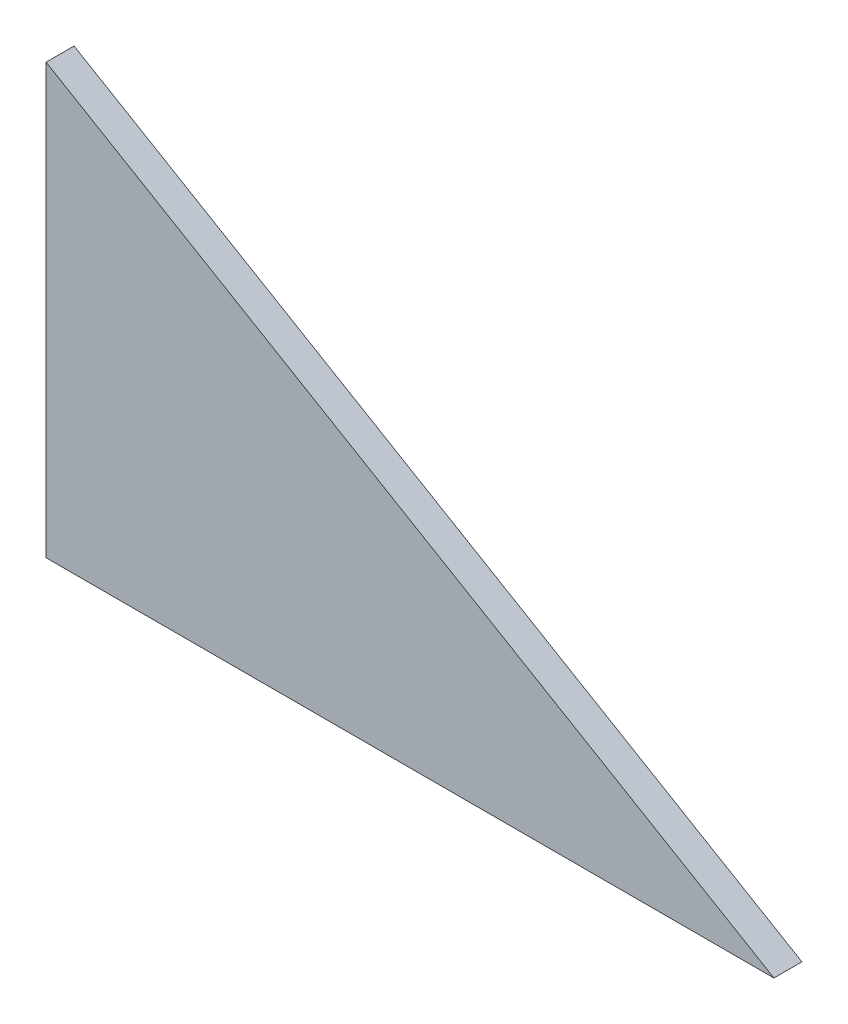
ISO-10303-21;
HEADER;
FILE_DESCRIPTION(('STEP AP214'),'2;1');
FILE_NAME('part.step','',(''),(''),'','','');
FILE_SCHEMA(('AUTOMOTIVE_DESIGN { 1 0 10303 214 1 1 1 1 }'));
ENDSEC;
DATA;
#1=APPLICATION_CONTEXT('core data for automotive mechanical design processes');
#2=APPLICATION_PROTOCOL_DEFINITION('international standard','automotive_design',2000,#1);
#3=PRODUCT_CONTEXT('',#1,'mechanical');
#4=PRODUCT('Part','Part','',(#3));
#5=PRODUCT_RELATED_PRODUCT_CATEGORY('part','',(#4));
#6=PRODUCT_DEFINITION_FORMATION('','',#4);
#7=PRODUCT_DEFINITION_CONTEXT('part definition',#1,'design');
#8=PRODUCT_DEFINITION('design','',#6,#7);
#9=PRODUCT_DEFINITION_SHAPE('','',#8);
#10=(LENGTH_UNIT() NAMED_UNIT(*) SI_UNIT(.MILLI.,.METRE.));
#11=(NAMED_UNIT(*) PLANE_ANGLE_UNIT() SI_UNIT($,.RADIAN.));
#12=(NAMED_UNIT(*) SI_UNIT($,.STERADIAN.) SOLID_ANGLE_UNIT());
#13=UNCERTAINTY_MEASURE_WITH_UNIT(LENGTH_MEASURE(1.E-05),#10,'distance_accuracy_value','');
#14=(GEOMETRIC_REPRESENTATION_CONTEXT(3) GLOBAL_UNCERTAINTY_ASSIGNED_CONTEXT((#13)) GLOBAL_UNIT_ASSIGNED_CONTEXT((#10,
#11,#12)) REPRESENTATION_CONTEXT('',''));
#15=CARTESIAN_POINT('',(0.,0.,0.));
#16=DIRECTION('',(0.,0.,1.));
#17=DIRECTION('',(1.,0.,0.));
#18=AXIS2_PLACEMENT_3D('',#15,#16,#17);
#19=CARTESIAN_POINT('',(247.65,0.,9.525));
#20=DIRECTION('',(0.,1.,0.));
#21=DIRECTION('',(-1.,0.,0.));
#22=AXIS2_PLACEMENT_3D('',#19,#20,#21);
#23=PLANE('',#22);
#24=DIRECTION('',(1.,0.,0.));
#25=VECTOR('',#24,1.);
#26=CARTESIAN_POINT('',(247.65,0.,0.));
#27=LINE('',#26,#25);
#28=CARTESIAN_POINT('',(0.,0.,0.));
#29=VERTEX_POINT('',#28);
#30=CARTESIAN_POINT('',(247.65,0.,0.));
#31=VERTEX_POINT('',#30);
#32=EDGE_CURVE('E83',#29,#31,#27,.T.);
#33=ORIENTED_EDGE('',*,*,#32,.T.);
#34=DIRECTION('',(0.,0.,-1.));
#35=VECTOR('',#34,1.);
#36=CARTESIAN_POINT('',(247.65,0.,9.525));
#37=LINE('',#36,#35);
#38=CARTESIAN_POINT('',(247.65,0.,9.525));
#39=VERTEX_POINT('',#38);
#40=EDGE_CURVE('E11',#39,#31,#37,.T.);
#41=ORIENTED_EDGE('',*,*,#40,.F.);
#42=DIRECTION('',(1.,0.,0.));
#43=VECTOR('',#42,1.);
#44=CARTESIAN_POINT('',(247.65,0.,9.525));
#45=LINE('',#44,#43);
#46=CARTESIAN_POINT('',(0.,0.,9.525));
#47=VERTEX_POINT('',#46);
#48=EDGE_CURVE('E76',#47,#39,#45,.T.);
#49=ORIENTED_EDGE('',*,*,#48,.F.);
#50=DIRECTION('',(0.,0.,-1.));
#51=VECTOR('',#50,1.);
#52=CARTESIAN_POINT('',(0.,0.,9.525));
#53=LINE('',#52,#51);
#54=EDGE_CURVE('E84',#47,#29,#53,.T.);
#55=ORIENTED_EDGE('',*,*,#54,.T.);
#56=EDGE_LOOP('',(#33,#41,#49,#55));
#57=FACE_BOUND('',#56,.T.);
#58=ADVANCED_FACE('F36',(#57),#23,.F.);
#59=CARTESIAN_POINT('',(0.,146.05,9.525));
#60=DIRECTION('',(-0.507985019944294,-0.861365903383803,0.));
#61=DIRECTION('',(0.861365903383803,-0.507985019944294,0.));
#62=AXIS2_PLACEMENT_3D('',#59,#60,#61);
#63=PLANE('',#62);
#64=DIRECTION('',(-0.861365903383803,0.507985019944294,0.));
#65=VECTOR('',#64,1.);
#66=CARTESIAN_POINT('',(0.,146.05,0.));
#67=LINE('',#66,#65);
#68=CARTESIAN_POINT('',(0.,146.05,0.));
#69=VERTEX_POINT('',#68);
#70=EDGE_CURVE('E64',#31,#69,#67,.T.);
#71=ORIENTED_EDGE('',*,*,#70,.T.);
#72=DIRECTION('',(0.,0.,-1.));
#73=VECTOR('',#72,1.);
#74=CARTESIAN_POINT('',(0.,146.05,9.525));
#75=LINE('',#74,#73);
#76=CARTESIAN_POINT('',(0.,146.05,9.525));
#77=VERTEX_POINT('',#76);
#78=EDGE_CURVE('E44',#77,#69,#75,.T.);
#79=ORIENTED_EDGE('',*,*,#78,.F.);
#80=DIRECTION('',(-0.861365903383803,0.507985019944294,0.));
#81=VECTOR('',#80,1.);
#82=CARTESIAN_POINT('',(0.,146.05,9.525));
#83=LINE('',#82,#81);
#84=EDGE_CURVE('E72',#39,#77,#83,.T.);
#85=ORIENTED_EDGE('',*,*,#84,.F.);
#86=ORIENTED_EDGE('',*,*,#40,.T.);
#87=EDGE_LOOP('',(#71,#79,#85,#86));
#88=FACE_BOUND('',#87,.T.);
#89=ADVANCED_FACE('F73',(#88),#63,.F.);
#90=CARTESIAN_POINT('',(0.,0.,9.525));
#91=DIRECTION('',(1.,0.,0.));
#92=DIRECTION('',(0.,1.,0.));
#93=AXIS2_PLACEMENT_3D('',#90,#91,#92);
#94=PLANE('',#93);
#95=DIRECTION('',(0.,-1.,0.));
#96=VECTOR('',#95,1.);
#97=CARTESIAN_POINT('',(0.,0.,0.));
#98=LINE('',#97,#96);
#99=EDGE_CURVE('E69',#69,#29,#98,.T.);
#100=ORIENTED_EDGE('',*,*,#99,.T.);
#101=ORIENTED_EDGE('',*,*,#54,.F.);
#102=DIRECTION('',(0.,-1.,0.));
#103=VECTOR('',#102,1.);
#104=CARTESIAN_POINT('',(0.,0.,9.525));
#105=LINE('',#104,#103);
#106=EDGE_CURVE('E52',#77,#47,#105,.T.);
#107=ORIENTED_EDGE('',*,*,#106,.F.);
#108=ORIENTED_EDGE('',*,*,#78,.T.);
#109=EDGE_LOOP('',(#100,#101,#107,#108));
#110=FACE_BOUND('',#109,.T.);
#111=ADVANCED_FACE('F91',(#110),#94,.F.);
#112=CARTESIAN_POINT('',(0.,0.,9.525));
#113=DIRECTION('',(0.,0.,-1.));
#114=DIRECTION('',(-1.,0.,0.));
#115=AXIS2_PLACEMENT_3D('',#112,#113,#114);
#116=PLANE('',#115);
#117=ORIENTED_EDGE('',*,*,#48,.T.);
#118=ORIENTED_EDGE('',*,*,#84,.T.);
#119=ORIENTED_EDGE('',*,*,#106,.T.);
#120=EDGE_LOOP('',(#117,#118,#119));
#121=FACE_BOUND('',#120,.T.);
#122=ADVANCED_FACE('F79',(#121),#116,.F.);
#123=CARTESIAN_POINT('',(0.,0.,0.));
#124=DIRECTION('',(0.,0.,-1.));
#125=DIRECTION('',(-1.,0.,0.));
#126=AXIS2_PLACEMENT_3D('',#123,#124,#125);
#127=PLANE('',#126);
#128=ORIENTED_EDGE('',*,*,#32,.F.);
#129=ORIENTED_EDGE('',*,*,#99,.F.);
#130=ORIENTED_EDGE('',*,*,#70,.F.);
#131=EDGE_LOOP('',(#128,#129,#130));
#132=FACE_BOUND('',#131,.T.);
#133=ADVANCED_FACE('F92',(#132),#127,.T.);
#134=CLOSED_SHELL('',(#58,#89,#111,#122,#133));
#135=MANIFOLD_SOLID_BREP('B2',#134);
#136=ADVANCED_BREP_SHAPE_REPRESENTATION('',(#18,#135),#14);
#137=SHAPE_DEFINITION_REPRESENTATION(#9,#136);
ENDSEC;
END-ISO-10303-21;
